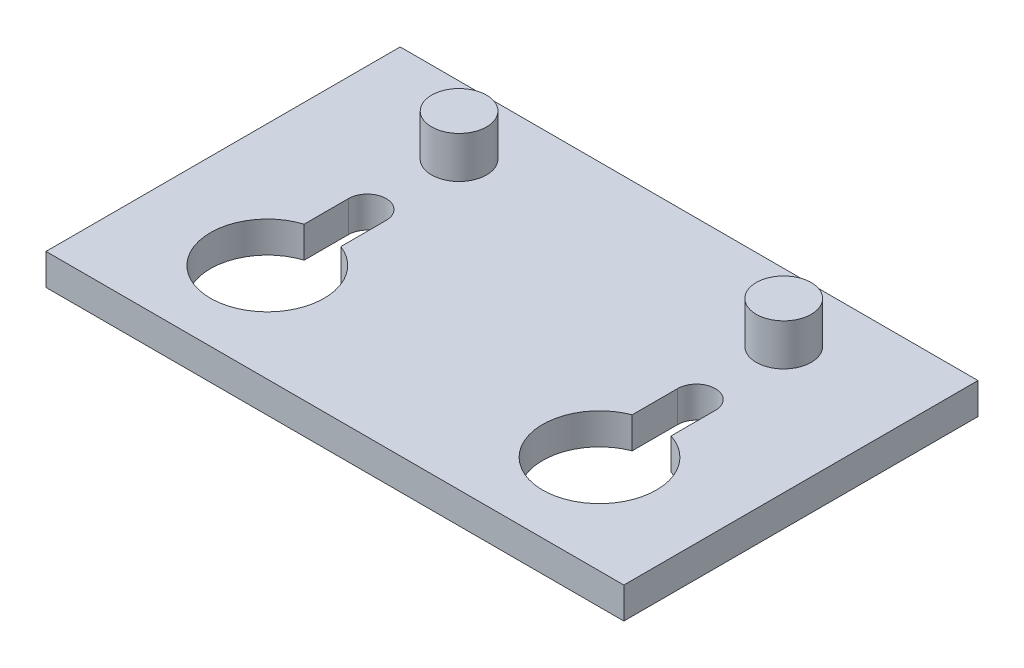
ISO-10303-21;
HEADER;
FILE_DESCRIPTION(('STEP AP214'),'2;1');
FILE_NAME('part.step','',(''),(''),'','','');
FILE_SCHEMA(('AUTOMOTIVE_DESIGN { 1 0 10303 214 1 1 1 1 }'));
ENDSEC;
DATA;
#1=APPLICATION_CONTEXT('core data for automotive mechanical design processes');
#2=APPLICATION_PROTOCOL_DEFINITION('international standard','automotive_design',2000,#1);
#3=PRODUCT_CONTEXT('',#1,'mechanical');
#4=PRODUCT('Part','Part','',(#3));
#5=PRODUCT_RELATED_PRODUCT_CATEGORY('part','',(#4));
#6=PRODUCT_DEFINITION_FORMATION('','',#4);
#7=PRODUCT_DEFINITION_CONTEXT('part definition',#1,'design');
#8=PRODUCT_DEFINITION('design','',#6,#7);
#9=PRODUCT_DEFINITION_SHAPE('','',#8);
#10=(LENGTH_UNIT() NAMED_UNIT(*) SI_UNIT(.MILLI.,.METRE.));
#11=(NAMED_UNIT(*) PLANE_ANGLE_UNIT() SI_UNIT($,.RADIAN.));
#12=(NAMED_UNIT(*) SI_UNIT($,.STERADIAN.) SOLID_ANGLE_UNIT());
#13=UNCERTAINTY_MEASURE_WITH_UNIT(LENGTH_MEASURE(1.E-05),#10,'distance_accuracy_value','');
#14=(GEOMETRIC_REPRESENTATION_CONTEXT(3) GLOBAL_UNCERTAINTY_ASSIGNED_CONTEXT((#13)) GLOBAL_UNIT_ASSIGNED_CONTEXT((#10,
#11,#12)) REPRESENTATION_CONTEXT('',''));
#15=CARTESIAN_POINT('',(0.,0.,0.));
#16=DIRECTION('',(0.,0.,1.));
#17=DIRECTION('',(1.,0.,0.));
#18=AXIS2_PLACEMENT_3D('',#15,#16,#17);
#19=CARTESIAN_POINT('',(-70.4701521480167,7.62,43.1913835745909));
#20=DIRECTION('',(0.,1.,0.));
#21=DIRECTION('',(0.,0.,1.));
#22=AXIS2_PLACEMENT_3D('',#19,#20,#21);
#23=PLANE('',#22);
#24=CARTESIAN_POINT('',(39.5900621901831,7.62,-26.6840507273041));
#25=DIRECTION('',(0.,1.,0.));
#26=DIRECTION('',(0.,0.,1.));
#27=AXIS2_PLACEMENT_3D('',#24,#25,#26);
#28=CIRCLE('',#27,6.70951587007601);
#29=CARTESIAN_POINT('',(39.5900621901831,7.62,-19.9745348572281));
#30=VERTEX_POINT('',#29);
#31=EDGE_CURVE('E11',#30,#30,#28,.T.);
#32=ORIENTED_EDGE('',*,*,#31,.F.);
#33=EDGE_LOOP('',(#32));
#34=FACE_BOUND('',#33,.T.);
#35=CARTESIAN_POINT('',(-39.5900621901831,7.62,-26.6840507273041));
#36=DIRECTION('',(0.,1.,0.));
#37=DIRECTION('',(0.,0.,1.));
#38=AXIS2_PLACEMENT_3D('',#35,#36,#37);
#39=CIRCLE('',#38,6.70951587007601);
#40=CARTESIAN_POINT('',(-39.5900621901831,7.62,-19.9745348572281));
#41=VERTEX_POINT('',#40);
#42=EDGE_CURVE('E147',#41,#41,#39,.T.);
#43=ORIENTED_EDGE('',*,*,#42,.F.);
#44=EDGE_LOOP('',(#43));
#45=FACE_BOUND('',#44,.T.);
#46=CARTESIAN_POINT('',(-40.138558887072,7.62,-4.85771005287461));
#47=DIRECTION('',(0.,1.,0.));
#48=DIRECTION('',(0.,0.,1.));
#49=AXIS2_PLACEMENT_3D('',#46,#47,#48);
#50=CIRCLE('',#49,4.6049602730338);
#51=CARTESIAN_POINT('',(-35.5335986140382,7.62,-4.85771005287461));
#52=VERTEX_POINT('',#51);
#53=CARTESIAN_POINT('',(-44.7435191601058,7.62,-4.85771005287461));
#54=VERTEX_POINT('',#53);
#55=EDGE_CURVE('E155',#52,#54,#50,.T.);
#56=ORIENTED_EDGE('',*,*,#55,.F.);
#57=DIRECTION('',(0.,0.,-1.));
#58=VECTOR('',#57,1.);
#59=CARTESIAN_POINT('',(-35.5335986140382,7.62,-4.85771005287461));
#60=LINE('',#59,#58);
#61=CARTESIAN_POINT('',(-35.5335986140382,7.62,6.21563081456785));
#62=VERTEX_POINT('',#61);
#63=EDGE_CURVE('E163',#62,#52,#60,.T.);
#64=ORIENTED_EDGE('',*,*,#63,.F.);
#65=CARTESIAN_POINT('',(-40.513092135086,7.62,19.166828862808));
#66=DIRECTION('',(0.,1.,0.));
#67=DIRECTION('',(0.,0.,1.));
#68=AXIS2_PLACEMENT_3D('',#65,#66,#67);
#69=CIRCLE('',#68,13.8754778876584);
#70=CARTESIAN_POINT('',(-44.7435191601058,7.62,5.9519745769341));
#71=VERTEX_POINT('',#70);
#72=EDGE_CURVE('E160',#71,#62,#69,.T.);
#73=ORIENTED_EDGE('',*,*,#72,.F.);
#74=DIRECTION('',(0.,0.,1.));
#75=VECTOR('',#74,1.);
#76=CARTESIAN_POINT('',(-44.7435191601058,7.62,-4.85771005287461));
#77=LINE('',#76,#75);
#78=EDGE_CURVE('E157',#54,#71,#77,.T.);
#79=ORIENTED_EDGE('',*,*,#78,.F.);
#80=EDGE_LOOP('',(#56,#64,#73,#79));
#81=FACE_BOUND('',#80,.T.);
#82=DIRECTION('',(0.,0.,1.));
#83=VECTOR('',#82,1.);
#84=CARTESIAN_POINT('',(-70.4701521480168,7.62,-43.1913835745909));
#85=LINE('',#84,#83);
#86=CARTESIAN_POINT('',(-70.4701521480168,7.62,-43.1913835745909));
#87=VERTEX_POINT('',#86);
#88=CARTESIAN_POINT('',(-70.4701521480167,7.62,43.1913835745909));
#89=VERTEX_POINT('',#88);
#90=EDGE_CURVE('E196',#87,#89,#85,.T.);
#91=ORIENTED_EDGE('',*,*,#90,.T.);
#92=DIRECTION('',(1.,0.,0.));
#93=VECTOR('',#92,1.);
#94=CARTESIAN_POINT('',(-70.4701521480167,7.62,43.1913835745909));
#95=LINE('',#94,#93);
#96=CARTESIAN_POINT('',(70.4701521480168,7.62,43.1913835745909));
#97=VERTEX_POINT('',#96);
#98=EDGE_CURVE('E199',#89,#97,#95,.T.);
#99=ORIENTED_EDGE('',*,*,#98,.T.);
#100=DIRECTION('',(0.,0.,-1.));
#101=VECTOR('',#100,1.);
#102=CARTESIAN_POINT('',(70.4701521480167,7.62,-43.1913835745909));
#103=LINE('',#102,#101);
#104=CARTESIAN_POINT('',(70.4701521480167,7.62,-43.1913835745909));
#105=VERTEX_POINT('',#104);
#106=EDGE_CURVE('E201',#97,#105,#103,.T.);
#107=ORIENTED_EDGE('',*,*,#106,.T.);
#108=DIRECTION('',(-1.,0.,0.));
#109=VECTOR('',#108,1.);
#110=CARTESIAN_POINT('',(-70.4701521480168,7.62,-43.1913835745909));
#111=LINE('',#110,#109);
#112=EDGE_CURVE('E203',#105,#87,#111,.T.);
#113=ORIENTED_EDGE('',*,*,#112,.T.);
#114=EDGE_LOOP('',(#91,#99,#107,#113));
#115=FACE_BOUND('',#114,.T.);
#116=DIRECTION('',(0.,0.,-1.));
#117=VECTOR('',#116,1.);
#118=CARTESIAN_POINT('',(35.5335986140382,7.62,-4.85771005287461));
#119=LINE('',#118,#117);
#120=CARTESIAN_POINT('',(35.5335986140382,7.62,6.21563081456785));
#121=VERTEX_POINT('',#120);
#122=CARTESIAN_POINT('',(35.5335986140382,7.62,-4.85771005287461));
#123=VERTEX_POINT('',#122);
#124=EDGE_CURVE('E129',#121,#123,#119,.T.);
#125=ORIENTED_EDGE('',*,*,#124,.T.);
#126=CARTESIAN_POINT('',(40.138558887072,7.62,-4.85771005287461));
#127=DIRECTION('',(0.,-1.,0.));
#128=DIRECTION('',(0.,0.,1.));
#129=AXIS2_PLACEMENT_3D('',#126,#127,#128);
#130=CIRCLE('',#129,4.6049602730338);
#131=CARTESIAN_POINT('',(44.7435191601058,7.62,-4.85771005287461));
#132=VERTEX_POINT('',#131);
#133=EDGE_CURVE('E42',#123,#132,#130,.T.);
#134=ORIENTED_EDGE('',*,*,#133,.T.);
#135=DIRECTION('',(0.,0.,1.));
#136=VECTOR('',#135,1.);
#137=CARTESIAN_POINT('',(44.7435191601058,7.62,-4.85771005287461));
#138=LINE('',#137,#136);
#139=CARTESIAN_POINT('',(44.7435191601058,7.62,5.9519745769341));
#140=VERTEX_POINT('',#139);
#141=EDGE_CURVE('E133',#132,#140,#138,.T.);
#142=ORIENTED_EDGE('',*,*,#141,.T.);
#143=CARTESIAN_POINT('',(40.513092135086,7.62,19.166828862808));
#144=DIRECTION('',(0.,-1.,0.));
#145=DIRECTION('',(0.,0.,1.));
#146=AXIS2_PLACEMENT_3D('',#143,#144,#145);
#147=CIRCLE('',#146,13.8754778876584);
#148=EDGE_CURVE('E120',#140,#121,#147,.T.);
#149=ORIENTED_EDGE('',*,*,#148,.T.);
#150=EDGE_LOOP('',(#125,#134,#142,#149));
#151=FACE_BOUND('',#150,.T.);
#152=ADVANCED_FACE('F27',(#34,#45,#81,#115,#151),#23,.T.);
#153=CARTESIAN_POINT('',(-70.4701521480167,0.,43.1913835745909));
#154=DIRECTION('',(0.,1.,0.));
#155=DIRECTION('',(0.,0.,1.));
#156=AXIS2_PLACEMENT_3D('',#153,#154,#155);
#157=PLANE('',#156);
#158=DIRECTION('',(0.,0.,1.));
#159=VECTOR('',#158,1.);
#160=CARTESIAN_POINT('',(-70.4701521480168,0.,-43.1913835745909));
#161=LINE('',#160,#159);
#162=CARTESIAN_POINT('',(-70.4701521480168,0.,-43.1913835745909));
#163=VERTEX_POINT('',#162);
#164=CARTESIAN_POINT('',(-70.4701521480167,0.,43.1913835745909));
#165=VERTEX_POINT('',#164);
#166=EDGE_CURVE('E181',#163,#165,#161,.T.);
#167=ORIENTED_EDGE('',*,*,#166,.F.);
#168=DIRECTION('',(-1.,0.,0.));
#169=VECTOR('',#168,1.);
#170=CARTESIAN_POINT('',(-70.4701521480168,0.,-43.1913835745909));
#171=LINE('',#170,#169);
#172=CARTESIAN_POINT('',(70.4701521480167,0.,-43.1913835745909));
#173=VERTEX_POINT('',#172);
#174=EDGE_CURVE('E194',#173,#163,#171,.T.);
#175=ORIENTED_EDGE('',*,*,#174,.F.);
#176=DIRECTION('',(0.,0.,-1.));
#177=VECTOR('',#176,1.);
#178=CARTESIAN_POINT('',(70.4701521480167,0.,-43.1913835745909));
#179=LINE('',#178,#177);
#180=CARTESIAN_POINT('',(70.4701521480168,0.,43.1913835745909));
#181=VERTEX_POINT('',#180);
#182=EDGE_CURVE('E192',#181,#173,#179,.T.);
#183=ORIENTED_EDGE('',*,*,#182,.F.);
#184=DIRECTION('',(1.,0.,0.));
#185=VECTOR('',#184,1.);
#186=CARTESIAN_POINT('',(-70.4701521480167,0.,43.1913835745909));
#187=LINE('',#186,#185);
#188=EDGE_CURVE('E190',#165,#181,#187,.T.);
#189=ORIENTED_EDGE('',*,*,#188,.F.);
#190=EDGE_LOOP('',(#167,#175,#183,#189));
#191=FACE_BOUND('',#190,.T.);
#192=DIRECTION('',(0.,0.,-1.));
#193=VECTOR('',#192,1.);
#194=CARTESIAN_POINT('',(-35.5335986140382,0.,-4.85771005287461));
#195=LINE('',#194,#193);
#196=CARTESIAN_POINT('',(-35.5335986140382,0.,6.21563081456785));
#197=VERTEX_POINT('',#196);
#198=CARTESIAN_POINT('',(-35.5335986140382,0.,-4.85771005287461));
#199=VERTEX_POINT('',#198);
#200=EDGE_CURVE('E175',#197,#199,#195,.T.);
#201=ORIENTED_EDGE('',*,*,#200,.T.);
#202=CARTESIAN_POINT('',(-40.138558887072,0.,-4.85771005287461));
#203=DIRECTION('',(0.,1.,0.));
#204=DIRECTION('',(0.,0.,1.));
#205=AXIS2_PLACEMENT_3D('',#202,#203,#204);
#206=CIRCLE('',#205,4.6049602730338);
#207=CARTESIAN_POINT('',(-44.7435191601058,0.,-4.85771005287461));
#208=VERTEX_POINT('',#207);
#209=EDGE_CURVE('E166',#199,#208,#206,.T.);
#210=ORIENTED_EDGE('',*,*,#209,.T.);
#211=DIRECTION('',(0.,0.,1.));
#212=VECTOR('',#211,1.);
#213=CARTESIAN_POINT('',(-44.7435191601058,0.,-4.85771005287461));
#214=LINE('',#213,#212);
#215=CARTESIAN_POINT('',(-44.7435191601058,0.,5.9519745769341));
#216=VERTEX_POINT('',#215);
#217=EDGE_CURVE('E169',#208,#216,#214,.T.);
#218=ORIENTED_EDGE('',*,*,#217,.T.);
#219=CARTESIAN_POINT('',(-40.513092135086,0.,19.166828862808));
#220=DIRECTION('',(0.,1.,0.));
#221=DIRECTION('',(0.,0.,1.));
#222=AXIS2_PLACEMENT_3D('',#219,#220,#221);
#223=CIRCLE('',#222,13.8754778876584);
#224=EDGE_CURVE('E172',#216,#197,#223,.T.);
#225=ORIENTED_EDGE('',*,*,#224,.T.);
#226=EDGE_LOOP('',(#201,#210,#218,#225));
#227=FACE_BOUND('',#226,.T.);
#228=CARTESIAN_POINT('',(40.138558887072,0.,-4.85771005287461));
#229=DIRECTION('',(0.,-1.,0.));
#230=DIRECTION('',(0.,0.,1.));
#231=AXIS2_PLACEMENT_3D('',#228,#229,#230);
#232=CIRCLE('',#231,4.6049602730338);
#233=CARTESIAN_POINT('',(35.5335986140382,0.,-4.85771005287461));
#234=VERTEX_POINT('',#233);
#235=CARTESIAN_POINT('',(44.7435191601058,0.,-4.85771005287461));
#236=VERTEX_POINT('',#235);
#237=EDGE_CURVE('E135',#234,#236,#232,.T.);
#238=ORIENTED_EDGE('',*,*,#237,.F.);
#239=DIRECTION('',(0.,0.,-1.));
#240=VECTOR('',#239,1.);
#241=CARTESIAN_POINT('',(35.5335986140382,0.,-4.85771005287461));
#242=LINE('',#241,#240);
#243=CARTESIAN_POINT('',(35.5335986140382,0.,6.21563081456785));
#244=VERTEX_POINT('',#243);
#245=EDGE_CURVE('E140',#244,#234,#242,.T.);
#246=ORIENTED_EDGE('',*,*,#245,.F.);
#247=CARTESIAN_POINT('',(40.513092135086,0.,19.166828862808));
#248=DIRECTION('',(0.,-1.,0.));
#249=DIRECTION('',(0.,0.,1.));
#250=AXIS2_PLACEMENT_3D('',#247,#248,#249);
#251=CIRCLE('',#250,13.8754778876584);
#252=CARTESIAN_POINT('',(44.7435191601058,0.,5.9519745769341));
#253=VERTEX_POINT('',#252);
#254=EDGE_CURVE('E123',#253,#244,#251,.T.);
#255=ORIENTED_EDGE('',*,*,#254,.F.);
#256=DIRECTION('',(0.,0.,1.));
#257=VECTOR('',#256,1.);
#258=CARTESIAN_POINT('',(44.7435191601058,0.,-4.85771005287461));
#259=LINE('',#258,#257);
#260=EDGE_CURVE('E143',#236,#253,#259,.T.);
#261=ORIENTED_EDGE('',*,*,#260,.F.);
#262=EDGE_LOOP('',(#238,#246,#255,#261));
#263=FACE_BOUND('',#262,.T.);
#264=ADVANCED_FACE('F224',(#191,#227,#263),#157,.F.);
#265=CARTESIAN_POINT('',(-70.4701521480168,7.62,-43.1913835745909));
#266=DIRECTION('',(1.,0.,0.));
#267=DIRECTION('',(0.,0.,-1.));
#268=AXIS2_PLACEMENT_3D('',#265,#266,#267);
#269=PLANE('',#268);
#270=ORIENTED_EDGE('',*,*,#166,.T.);
#271=DIRECTION('',(0.,-1.,0.));
#272=VECTOR('',#271,1.);
#273=CARTESIAN_POINT('',(-70.4701521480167,7.62,43.1913835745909));
#274=LINE('',#273,#272);
#275=EDGE_CURVE('E35',#89,#165,#274,.T.);
#276=ORIENTED_EDGE('',*,*,#275,.F.);
#277=ORIENTED_EDGE('',*,*,#90,.F.);
#278=DIRECTION('',(0.,-1.,0.));
#279=VECTOR('',#278,1.);
#280=CARTESIAN_POINT('',(-70.4701521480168,7.62,-43.1913835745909));
#281=LINE('',#280,#279);
#282=EDGE_CURVE('E205',#87,#163,#281,.T.);
#283=ORIENTED_EDGE('',*,*,#282,.T.);
#284=EDGE_LOOP('',(#270,#276,#277,#283));
#285=FACE_BOUND('',#284,.T.);
#286=ADVANCED_FACE('F29',(#285),#269,.F.);
#287=CARTESIAN_POINT('',(-70.4701521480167,7.62,43.1913835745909));
#288=DIRECTION('',(0.,0.,-1.));
#289=DIRECTION('',(-1.,0.,0.));
#290=AXIS2_PLACEMENT_3D('',#287,#288,#289);
#291=PLANE('',#290);
#292=ORIENTED_EDGE('',*,*,#188,.T.);
#293=DIRECTION('',(0.,-1.,0.));
#294=VECTOR('',#293,1.);
#295=CARTESIAN_POINT('',(70.4701521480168,7.62,43.1913835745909));
#296=LINE('',#295,#294);
#297=EDGE_CURVE('E211',#97,#181,#296,.T.);
#298=ORIENTED_EDGE('',*,*,#297,.F.);
#299=ORIENTED_EDGE('',*,*,#98,.F.);
#300=ORIENTED_EDGE('',*,*,#275,.T.);
#301=EDGE_LOOP('',(#292,#298,#299,#300));
#302=FACE_BOUND('',#301,.T.);
#303=ADVANCED_FACE('F216',(#302),#291,.F.);
#304=CARTESIAN_POINT('',(70.4701521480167,7.62,-43.1913835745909));
#305=DIRECTION('',(-1.,0.,0.));
#306=DIRECTION('',(0.,0.,1.));
#307=AXIS2_PLACEMENT_3D('',#304,#305,#306);
#308=PLANE('',#307);
#309=ORIENTED_EDGE('',*,*,#182,.T.);
#310=DIRECTION('',(0.,-1.,0.));
#311=VECTOR('',#310,1.);
#312=CARTESIAN_POINT('',(70.4701521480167,7.62,-43.1913835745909));
#313=LINE('',#312,#311);
#314=EDGE_CURVE('E208',#105,#173,#313,.T.);
#315=ORIENTED_EDGE('',*,*,#314,.F.);
#316=ORIENTED_EDGE('',*,*,#106,.F.);
#317=ORIENTED_EDGE('',*,*,#297,.T.);
#318=EDGE_LOOP('',(#309,#315,#316,#317));
#319=FACE_BOUND('',#318,.T.);
#320=ADVANCED_FACE('F229',(#319),#308,.F.);
#321=CARTESIAN_POINT('',(-70.4701521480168,7.62,-43.1913835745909));
#322=DIRECTION('',(0.,0.,1.));
#323=DIRECTION('',(1.,0.,0.));
#324=AXIS2_PLACEMENT_3D('',#321,#322,#323);
#325=PLANE('',#324);
#326=ORIENTED_EDGE('',*,*,#174,.T.);
#327=ORIENTED_EDGE('',*,*,#282,.F.);
#328=ORIENTED_EDGE('',*,*,#112,.F.);
#329=ORIENTED_EDGE('',*,*,#314,.T.);
#330=EDGE_LOOP('',(#326,#327,#328,#329));
#331=FACE_BOUND('',#330,.T.);
#332=ADVANCED_FACE('F233',(#331),#325,.F.);
#333=CARTESIAN_POINT('',(-40.138558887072,0.,-4.85771005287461));
#334=DIRECTION('',(0.,1.,0.));
#335=DIRECTION('',(0.,0.,1.));
#336=AXIS2_PLACEMENT_3D('',#333,#334,#335);
#337=CYLINDRICAL_SURFACE('',#336,4.6049602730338);
#338=ORIENTED_EDGE('',*,*,#55,.T.);
#339=DIRECTION('',(0.,1.,0.));
#340=VECTOR('',#339,1.);
#341=CARTESIAN_POINT('',(-44.7435191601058,0.,-4.85771005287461));
#342=LINE('',#341,#340);
#343=EDGE_CURVE('E178',#208,#54,#342,.T.);
#344=ORIENTED_EDGE('',*,*,#343,.F.);
#345=ORIENTED_EDGE('',*,*,#209,.F.);
#346=DIRECTION('',(0.,1.,0.));
#347=VECTOR('',#346,1.);
#348=CARTESIAN_POINT('',(-35.5335986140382,0.,-4.85771005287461));
#349=LINE('',#348,#347);
#350=EDGE_CURVE('E179',#199,#52,#349,.T.);
#351=ORIENTED_EDGE('',*,*,#350,.T.);
#352=EDGE_LOOP('',(#338,#344,#345,#351));
#353=FACE_BOUND('',#352,.T.);
#354=ADVANCED_FACE('F249',(#353),#337,.F.);
#355=CARTESIAN_POINT('',(-35.5335986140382,0.,-4.85771005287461));
#356=DIRECTION('',(1.,0.,0.));
#357=DIRECTION('',(0.,0.,-1.));
#358=AXIS2_PLACEMENT_3D('',#355,#356,#357);
#359=PLANE('',#358);
#360=ORIENTED_EDGE('',*,*,#63,.T.);
#361=ORIENTED_EDGE('',*,*,#350,.F.);
#362=ORIENTED_EDGE('',*,*,#200,.F.);
#363=DIRECTION('',(0.,1.,0.));
#364=VECTOR('',#363,1.);
#365=CARTESIAN_POINT('',(-35.5335986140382,0.,6.21563081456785));
#366=LINE('',#365,#364);
#367=EDGE_CURVE('E182',#197,#62,#366,.T.);
#368=ORIENTED_EDGE('',*,*,#367,.T.);
#369=EDGE_LOOP('',(#360,#361,#362,#368));
#370=FACE_BOUND('',#369,.T.);
#371=ADVANCED_FACE('F274',(#370),#359,.F.);
#372=CARTESIAN_POINT('',(-40.513092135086,0.,19.166828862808));
#373=DIRECTION('',(0.,1.,0.));
#374=DIRECTION('',(0.,0.,1.));
#375=AXIS2_PLACEMENT_3D('',#372,#373,#374);
#376=CYLINDRICAL_SURFACE('',#375,13.8754778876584);
#377=ORIENTED_EDGE('',*,*,#72,.T.);
#378=ORIENTED_EDGE('',*,*,#367,.F.);
#379=ORIENTED_EDGE('',*,*,#224,.F.);
#380=DIRECTION('',(0.,1.,0.));
#381=VECTOR('',#380,1.);
#382=CARTESIAN_POINT('',(-44.7435191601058,0.,5.9519745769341));
#383=LINE('',#382,#381);
#384=EDGE_CURVE('E184',#216,#71,#383,.T.);
#385=ORIENTED_EDGE('',*,*,#384,.T.);
#386=EDGE_LOOP('',(#377,#378,#379,#385));
#387=FACE_BOUND('',#386,.T.);
#388=ADVANCED_FACE('F281',(#387),#376,.F.);
#389=CARTESIAN_POINT('',(-44.7435191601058,0.,-4.85771005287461));
#390=DIRECTION('',(-1.,0.,0.));
#391=DIRECTION('',(0.,0.,1.));
#392=AXIS2_PLACEMENT_3D('',#389,#390,#391);
#393=PLANE('',#392);
#394=ORIENTED_EDGE('',*,*,#78,.T.);
#395=ORIENTED_EDGE('',*,*,#384,.F.);
#396=ORIENTED_EDGE('',*,*,#217,.F.);
#397=ORIENTED_EDGE('',*,*,#343,.T.);
#398=EDGE_LOOP('',(#394,#395,#396,#397));
#399=FACE_BOUND('',#398,.T.);
#400=ADVANCED_FACE('F289',(#399),#393,.F.);
#401=CARTESIAN_POINT('',(-39.5900621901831,17.78,-26.6840507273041));
#402=DIRECTION('',(0.,-1.,0.));
#403=DIRECTION('',(0.,0.,-1.));
#404=AXIS2_PLACEMENT_3D('',#401,#402,#403);
#405=CYLINDRICAL_SURFACE('',#404,6.70951587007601);
#406=CARTESIAN_POINT('',(-39.5900621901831,17.78,-26.6840507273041));
#407=DIRECTION('',(0.,1.,0.));
#408=DIRECTION('',(0.,0.,1.));
#409=AXIS2_PLACEMENT_3D('',#406,#407,#408);
#410=CIRCLE('',#409,6.70951587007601);
#411=CARTESIAN_POINT('',(-39.5900621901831,17.78,-19.9745348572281));
#412=VERTEX_POINT('',#411);
#413=EDGE_CURVE('E152',#412,#412,#410,.T.);
#414=ORIENTED_EDGE('',*,*,#413,.F.);
#415=EDGE_LOOP('',(#414));
#416=FACE_BOUND('',#415,.T.);
#417=ORIENTED_EDGE('',*,*,#42,.T.);
#418=EDGE_LOOP('',(#417));
#419=FACE_BOUND('',#418,.T.);
#420=ADVANCED_FACE('F297',(#416,#419),#405,.T.);
#421=CARTESIAN_POINT('',(-39.5900621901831,17.78,-26.6840507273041));
#422=DIRECTION('',(0.,1.,0.));
#423=DIRECTION('',(0.,0.,1.));
#424=AXIS2_PLACEMENT_3D('',#421,#422,#423);
#425=PLANE('',#424);
#426=ORIENTED_EDGE('',*,*,#413,.T.);
#427=EDGE_LOOP('',(#426));
#428=FACE_BOUND('',#427,.T.);
#429=ADVANCED_FACE('F305',(#428),#425,.T.);
#430=CARTESIAN_POINT('',(40.138558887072,0.,-4.85771005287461));
#431=DIRECTION('',(0.,1.,0.));
#432=DIRECTION('',(0.,0.,1.));
#433=AXIS2_PLACEMENT_3D('',#430,#431,#432);
#434=CYLINDRICAL_SURFACE('',#433,4.6049602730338);
#435=ORIENTED_EDGE('',*,*,#133,.F.);
#436=DIRECTION('',(0.,1.,0.));
#437=VECTOR('',#436,1.);
#438=CARTESIAN_POINT('',(35.5335986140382,0.,-4.85771005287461));
#439=LINE('',#438,#437);
#440=EDGE_CURVE('E126',#234,#123,#439,.T.);
#441=ORIENTED_EDGE('',*,*,#440,.F.);
#442=ORIENTED_EDGE('',*,*,#237,.T.);
#443=DIRECTION('',(0.,1.,0.));
#444=VECTOR('',#443,1.);
#445=CARTESIAN_POINT('',(44.7435191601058,0.,-4.85771005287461));
#446=LINE('',#445,#444);
#447=EDGE_CURVE('E145',#236,#132,#446,.T.);
#448=ORIENTED_EDGE('',*,*,#447,.T.);
#449=EDGE_LOOP('',(#435,#441,#442,#448));
#450=FACE_BOUND('',#449,.T.);
#451=ADVANCED_FACE('F312',(#450),#434,.F.);
#452=CARTESIAN_POINT('',(44.7435191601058,0.,-4.85771005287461));
#453=DIRECTION('',(-1.,0.,0.));
#454=DIRECTION('',(0.,0.,1.));
#455=AXIS2_PLACEMENT_3D('',#452,#453,#454);
#456=PLANE('',#455);
#457=ORIENTED_EDGE('',*,*,#141,.F.);
#458=ORIENTED_EDGE('',*,*,#447,.F.);
#459=ORIENTED_EDGE('',*,*,#260,.T.);
#460=DIRECTION('',(0.,1.,0.));
#461=VECTOR('',#460,1.);
#462=CARTESIAN_POINT('',(44.7435191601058,0.,5.9519745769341));
#463=LINE('',#462,#461);
#464=EDGE_CURVE('E125',#253,#140,#463,.T.);
#465=ORIENTED_EDGE('',*,*,#464,.T.);
#466=EDGE_LOOP('',(#457,#458,#459,#465));
#467=FACE_BOUND('',#466,.T.);
#468=ADVANCED_FACE('F326',(#467),#456,.T.);
#469=CARTESIAN_POINT('',(40.513092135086,0.,19.166828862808));
#470=DIRECTION('',(0.,1.,0.));
#471=DIRECTION('',(0.,0.,1.));
#472=AXIS2_PLACEMENT_3D('',#469,#470,#471);
#473=CYLINDRICAL_SURFACE('',#472,13.8754778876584);
#474=ORIENTED_EDGE('',*,*,#148,.F.);
#475=ORIENTED_EDGE('',*,*,#464,.F.);
#476=ORIENTED_EDGE('',*,*,#254,.T.);
#477=DIRECTION('',(0.,1.,0.));
#478=VECTOR('',#477,1.);
#479=CARTESIAN_POINT('',(35.5335986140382,0.,6.21563081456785));
#480=LINE('',#479,#478);
#481=EDGE_CURVE('E50',#244,#121,#480,.T.);
#482=ORIENTED_EDGE('',*,*,#481,.T.);
#483=EDGE_LOOP('',(#474,#475,#476,#482));
#484=FACE_BOUND('',#483,.T.);
#485=ADVANCED_FACE('F117',(#484),#473,.F.);
#486=CARTESIAN_POINT('',(35.5335986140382,0.,-4.85771005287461));
#487=DIRECTION('',(1.,0.,0.));
#488=DIRECTION('',(0.,0.,-1.));
#489=AXIS2_PLACEMENT_3D('',#486,#487,#488);
#490=PLANE('',#489);
#491=ORIENTED_EDGE('',*,*,#124,.F.);
#492=ORIENTED_EDGE('',*,*,#481,.F.);
#493=ORIENTED_EDGE('',*,*,#245,.T.);
#494=ORIENTED_EDGE('',*,*,#440,.T.);
#495=EDGE_LOOP('',(#491,#492,#493,#494));
#496=FACE_BOUND('',#495,.T.);
#497=ADVANCED_FACE('F130',(#496),#490,.T.);
#498=CARTESIAN_POINT('',(39.5900621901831,17.78,-26.6840507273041));
#499=DIRECTION('',(0.,-1.,0.));
#500=DIRECTION('',(0.,0.,-1.));
#501=AXIS2_PLACEMENT_3D('',#498,#499,#500);
#502=CYLINDRICAL_SURFACE('',#501,6.70951587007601);
#503=CARTESIAN_POINT('',(39.5900621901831,17.78,-26.6840507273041));
#504=DIRECTION('',(0.,-1.,0.));
#505=DIRECTION('',(0.,0.,1.));
#506=AXIS2_PLACEMENT_3D('',#503,#504,#505);
#507=CIRCLE('',#506,6.70951587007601);
#508=CARTESIAN_POINT('',(39.5900621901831,17.78,-19.9745348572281));
#509=VERTEX_POINT('',#508);
#510=EDGE_CURVE('E365',#509,#509,#507,.T.);
#511=ORIENTED_EDGE('',*,*,#510,.T.);
#512=EDGE_LOOP('',(#511));
#513=FACE_BOUND('',#512,.T.);
#514=ORIENTED_EDGE('',*,*,#31,.T.);
#515=EDGE_LOOP('',(#514));
#516=FACE_BOUND('',#515,.T.);
#517=ADVANCED_FACE('F346',(#513,#516),#502,.T.);
#518=CARTESIAN_POINT('',(39.5900621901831,17.78,-26.6840507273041));
#519=DIRECTION('',(0.,1.,0.));
#520=DIRECTION('',(0.,0.,1.));
#521=AXIS2_PLACEMENT_3D('',#518,#519,#520);
#522=PLANE('',#521);
#523=ORIENTED_EDGE('',*,*,#510,.F.);
#524=EDGE_LOOP('',(#523));
#525=FACE_BOUND('',#524,.T.);
#526=ADVANCED_FACE('F353',(#525),#522,.T.);
#527=CLOSED_SHELL('',(#152,#264,#286,#303,#320,#332,#354,#371,#388,#400,#420,#429,#451,#468,
#485,#497,#517,#526));
#528=MANIFOLD_SOLID_BREP('B2',#527);
#529=ADVANCED_BREP_SHAPE_REPRESENTATION('',(#18,#528),#14);
#530=SHAPE_DEFINITION_REPRESENTATION(#9,#529);
ENDSEC;
END-ISO-10303-21;
